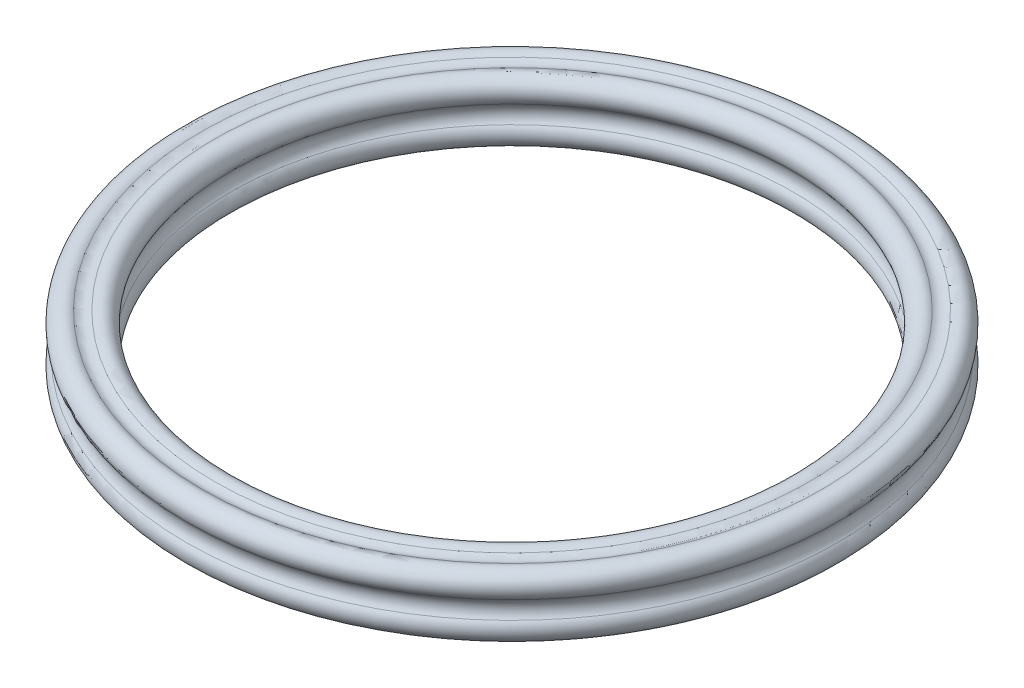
from build123d import *


with BuildPart() as part:
    # Esquisse1 → Base (revolve)
    with BuildSketch(Plane.XY, mode=Mode.PRIVATE) as base_sk:
        with BuildLine():
            ThreePointArc((17.725476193, -0.56375), (17.675067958, -1.633056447), (18.72625, -1.835475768))
            ThreePointArc((18.72625, -1.835475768), (19.135, -1.725951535), (19.54375, -1.835475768))
            ThreePointArc((19.54375, -1.835475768), (20.594932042, -1.633056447), (20.544523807, -0.56375))
            ThreePointArc((20.544523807, -0.56375), (20.319047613, 0), (20.544523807, 0.56375))
            ThreePointArc((20.544523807, 0.56375), (20.594932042, 1.633056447), (19.54375, 1.835475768))
            ThreePointArc((19.54375, 1.835475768), (19.135, 1.725951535), (18.72625, 1.835475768))
            ThreePointArc((18.72625, 1.835475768), (17.675067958, 1.633056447), (17.725476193, 0.56375))
            ThreePointArc((17.725476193, 0.56375), (17.950952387, 0), (17.725476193, -0.56375))
        make_face()
    revolve(base_sk.sketch.rotate(Axis((0, 4.28, 0), (0, -1, 0)), 90), axis=Axis((0, 4.28, 0), (0, -1, 0)))


solid = part.part
